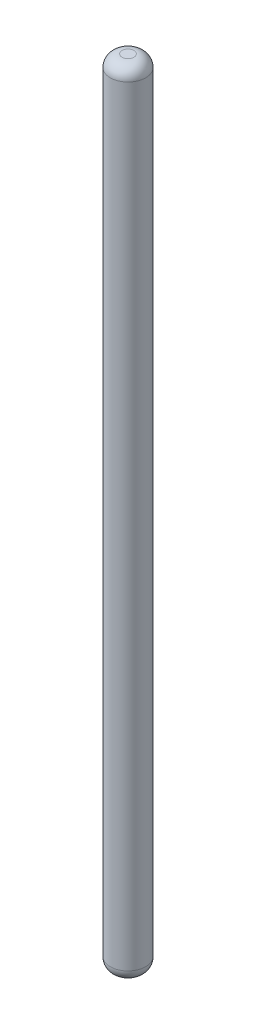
from build123d import *

# Parameters (mm, degrees)
SKETCH1_R           = 1.5
BOSS_EXTRUDE1_DEPTH = 67
FILLET1_R           = 1


with BuildPart() as part:
    # Sketch1 → Boss-Extrude1 (new body)
    with BuildSketch(Plane(origin=(0, 0, 0), x_dir=(1, 0, 0), z_dir=(0, 1, 0))):
        with Locations(Location((0, 0, 0), (0, 0, 270))):
            Circle(SKETCH1_R)
    extrude(amount=BOSS_EXTRUDE1_DEPTH)

    # Fillet1
    fillet1_edges = [part.edges().sort_by_distance(p)[0] for p in [
        (0, 0, -1.5),
        (0, 67, -1.5),
    ]]
    fillet(fillet1_edges, radius=FILLET1_R)


solid = part.part
